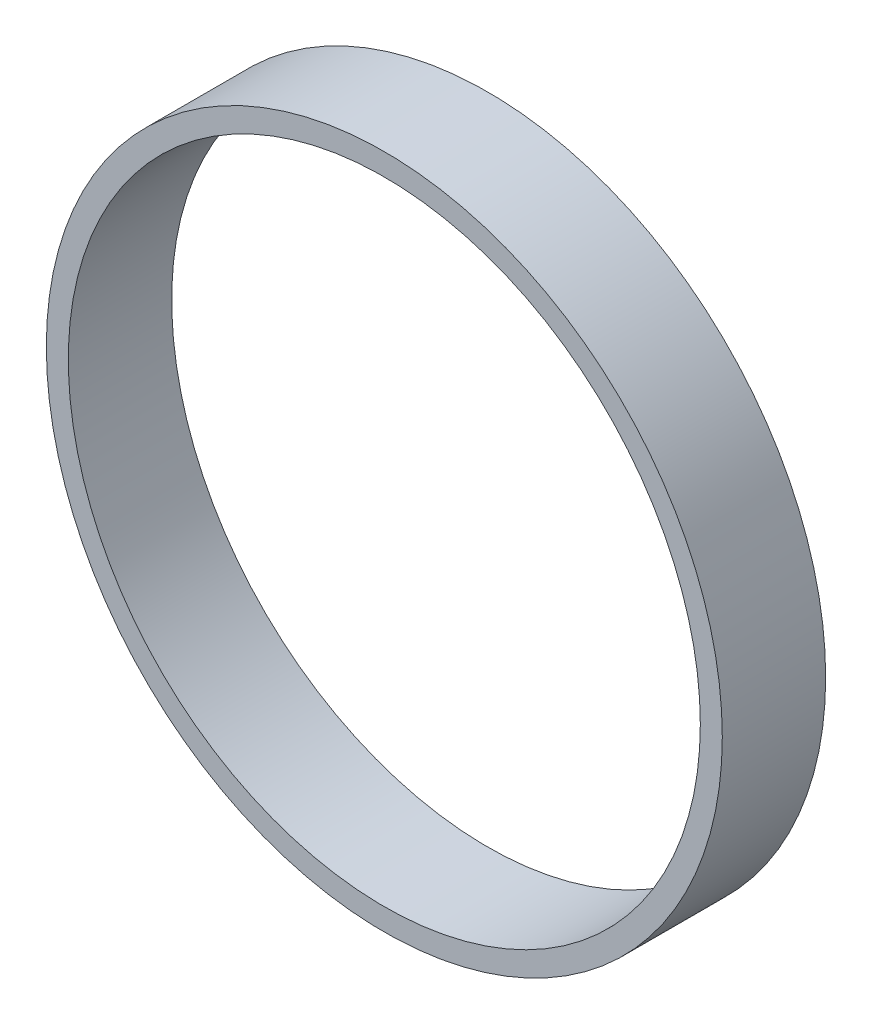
from build123d import *

# Parameters (mm, degrees)
SKETCH1_R      = 83.05
SKETCH1_R_2    = 77.65
BASEPIPE_DEPTH = 12.7


with BuildPart() as part:
    # Sketch1 → BasePipe (new, symmetric)
    with BuildSketch(Plane.XY):
        Circle(SKETCH1_R)
        Circle(SKETCH1_R_2, mode=Mode.SUBTRACT)
    extrude(amount=BASEPIPE_DEPTH, both=True)


solid = part.part
